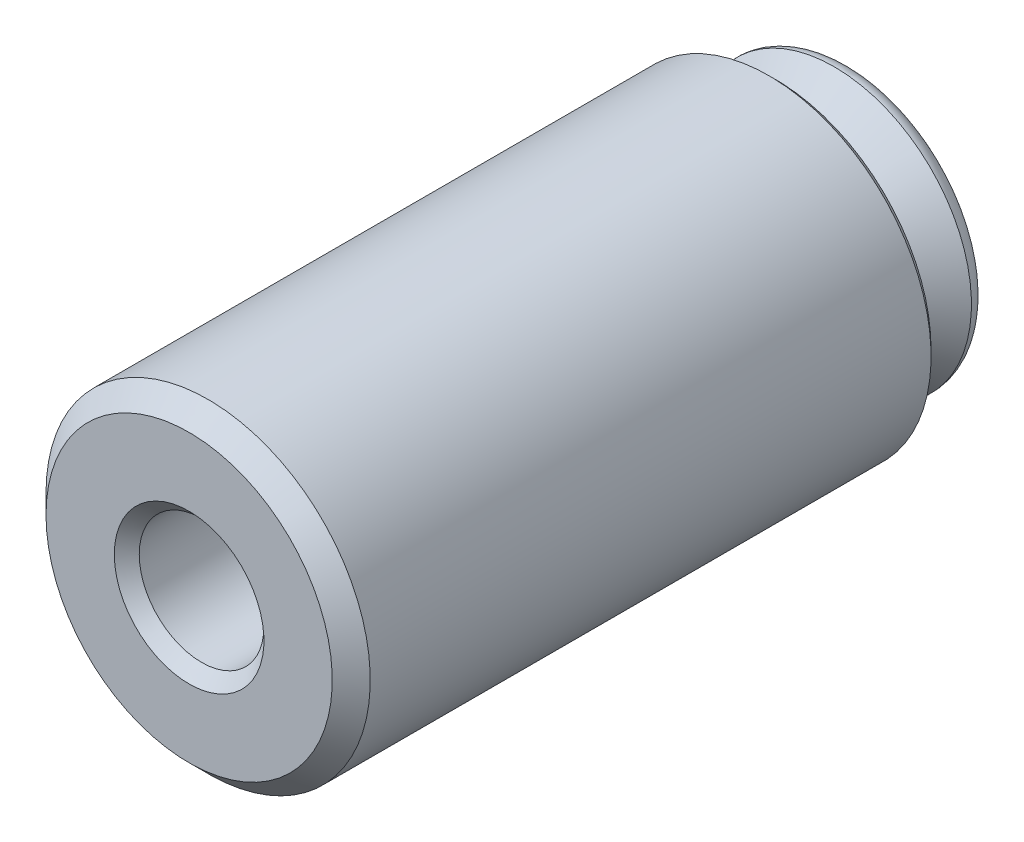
ISO-10303-21;
HEADER;
FILE_DESCRIPTION(('STEP AP214'),'2;1');
FILE_NAME('part.step','',(''),(''),'','','');
FILE_SCHEMA(('AUTOMOTIVE_DESIGN { 1 0 10303 214 1 1 1 1 }'));
ENDSEC;
DATA;
#1=APPLICATION_CONTEXT('core data for automotive mechanical design processes');
#2=APPLICATION_PROTOCOL_DEFINITION('international standard','automotive_design',2000,#1);
#3=PRODUCT_CONTEXT('',#1,'mechanical');
#4=PRODUCT('Part','Part','',(#3));
#5=PRODUCT_RELATED_PRODUCT_CATEGORY('part','',(#4));
#6=PRODUCT_DEFINITION_FORMATION('','',#4);
#7=PRODUCT_DEFINITION_CONTEXT('part definition',#1,'design');
#8=PRODUCT_DEFINITION('design','',#6,#7);
#9=PRODUCT_DEFINITION_SHAPE('','',#8);
#10=(LENGTH_UNIT() NAMED_UNIT(*) SI_UNIT(.MILLI.,.METRE.));
#11=(NAMED_UNIT(*) PLANE_ANGLE_UNIT() SI_UNIT($,.RADIAN.));
#12=(NAMED_UNIT(*) SI_UNIT($,.STERADIAN.) SOLID_ANGLE_UNIT());
#13=UNCERTAINTY_MEASURE_WITH_UNIT(LENGTH_MEASURE(1.E-05),#10,'distance_accuracy_value','');
#14=(GEOMETRIC_REPRESENTATION_CONTEXT(3) GLOBAL_UNCERTAINTY_ASSIGNED_CONTEXT((#13)) GLOBAL_UNIT_ASSIGNED_CONTEXT((#10,
#11,#12)) REPRESENTATION_CONTEXT('',''));
#15=CARTESIAN_POINT('',(0.,0.,0.));
#16=DIRECTION('',(0.,0.,1.));
#17=DIRECTION('',(1.,0.,0.));
#18=AXIS2_PLACEMENT_3D('',#15,#16,#17);
#19=CARTESIAN_POINT('',(0.,0.,6.50139999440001));
#20=DIRECTION('',(0.,0.,-1.));
#21=DIRECTION('',(-0.182612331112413,0.983184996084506,0.));
#22=AXIS2_PLACEMENT_3D('',#19,#20,#21);
#23=SPHERICAL_SURFACE('',#22,5.);
#24=CARTESIAN_POINT('',(0.,0.,4.2191999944));
#25=DIRECTION('',(0.,0.,-1.));
#26=DIRECTION('',(-1.,0.,0.));
#27=AXIS2_PLACEMENT_3D('',#24,#25,#26);
#28=CIRCLE('',#27,4.44877097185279);
#29=CARTESIAN_POINT('',(-0.812400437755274,4.37396487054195,4.2191999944));
#30=VERTEX_POINT('',#29);
#31=EDGE_CURVE('E8',#30,#30,#28,.F.);
#32=CARTESIAN_POINT('',(0.,0.,3.56696480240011));
#33=DIRECTION('',(0.,0.,1.));
#34=DIRECTION('',(-0.182612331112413,0.983184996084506,0.));
#35=AXIS2_PLACEMENT_3D('',#32,#33,#34);
#36=CIRCLE('',#35,4.04834411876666);
#37=CARTESIAN_POINT('',(-0.739277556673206,3.98027119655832,3.56696480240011));
#38=VERTEX_POINT('',#37);
#39=EDGE_CURVE('E41',#38,#38,#36,.T.);
#40=CARTESIAN_POINT('',(-0.812400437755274,4.37396487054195,4.2191999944));
#41=CARTESIAN_POINT('',(-0.811735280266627,4.370383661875,4.21209962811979));
#42=CARTESIAN_POINT('',(-0.811067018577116,4.36678574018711,4.20500798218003));
#43=CARTESIAN_POINT('',(-0.809724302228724,4.35955655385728,4.19084229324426));
#44=CARTESIAN_POINT('',(-0.809049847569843,4.35592528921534,4.18376825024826));
#45=CARTESIAN_POINT('',(-0.80769476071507,4.34862950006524,4.16963792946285));
#46=CARTESIAN_POINT('',(-0.807014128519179,4.34496497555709,4.16258165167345));
#47=CARTESIAN_POINT('',(-0.805646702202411,4.33760275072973,4.14848702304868));
#48=CARTESIAN_POINT('',(-0.804959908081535,4.33390505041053,4.14144867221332));
#49=CARTESIAN_POINT('',(-0.803580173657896,4.32647655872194,4.12739005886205));
#50=CARTESIAN_POINT('',(-0.802887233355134,4.32274576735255,4.12036979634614));
#51=CARTESIAN_POINT('',(-0.80149522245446,4.31525117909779,4.10634752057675));
#52=CARTESIAN_POINT('',(-0.800796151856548,4.31148738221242,4.09934550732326));
#53=CARTESIAN_POINT('',(-0.79939189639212,4.30392686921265,4.08535989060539));
#54=CARTESIAN_POINT('',(-0.798686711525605,4.30013015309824,4.078376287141));
#55=CARTESIAN_POINT('',(-0.797270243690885,4.29250388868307,4.06442765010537));
#56=CARTESIAN_POINT('',(-0.796558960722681,4.28867434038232,4.05746261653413));
#57=CARTESIAN_POINT('',(-0.795130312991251,4.28098249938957,4.04355127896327));
#58=CARTESIAN_POINT('',(-0.794412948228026,4.27712020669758,4.03660497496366));
#59=CARTESIAN_POINT('',(-0.792972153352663,4.26936296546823,4.0227312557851));
#60=CARTESIAN_POINT('',(-0.792248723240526,4.26546801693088,4.01580384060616));
#61=CARTESIAN_POINT('',(-0.790795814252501,4.25764555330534,4.00196805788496));
#62=CARTESIAN_POINT('',(-0.790066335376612,4.25371803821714,3.99505969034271));
#63=CARTESIAN_POINT('',(-0.788601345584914,4.24583053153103,3.98126216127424));
#64=CARTESIAN_POINT('',(-0.787865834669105,4.24187053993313,3.97437299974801));
#65=CARTESIAN_POINT('',(-0.786388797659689,4.23391817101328,3.96061404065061));
#66=CARTESIAN_POINT('',(-0.785647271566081,4.22992579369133,3.95374424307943));
#67=CARTESIAN_POINT('',(-0.784158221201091,4.22190874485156,3.94002416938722));
#68=CARTESIAN_POINT('',(-0.783410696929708,4.21788407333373,3.93317389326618));
#69=CARTESIAN_POINT('',(-0.781909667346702,4.2098025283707,3.91949301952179));
#70=CARTESIAN_POINT('',(-0.78115616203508,4.20574565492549,3.91266242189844));
#71=CARTESIAN_POINT('',(-0.779643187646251,4.19759979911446,3.89902106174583));
#72=CARTESIAN_POINT('',(-0.778883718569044,4.19351081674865,3.89221029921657));
#73=CARTESIAN_POINT('',(-0.777358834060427,4.18530083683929,3.8786087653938));
#74=CARTESIAN_POINT('',(-0.776593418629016,4.18117983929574,3.8718179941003));
#75=CARTESIAN_POINT('',(-0.775056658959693,4.17290592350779,3.85825659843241));
#76=CARTESIAN_POINT('',(-0.774285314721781,4.16875300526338,3.85148597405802));
#77=CARTESIAN_POINT('',(-0.772736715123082,4.16041534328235,3.83796502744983));
#78=CARTESIAN_POINT('',(-0.771959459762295,4.15623059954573,3.83121470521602));
#79=CARTESIAN_POINT('',(-0.770399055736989,4.14782938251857,3.81773451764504));
#80=CARTESIAN_POINT('',(-0.76961590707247,4.14361290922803,3.81100465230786));
#81=CARTESIAN_POINT('',(-0.76804373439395,4.13514832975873,3.79756553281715));
#82=CARTESIAN_POINT('',(-0.76725471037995,4.13090022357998,3.79085627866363));
#83=CARTESIAN_POINT('',(-0.765670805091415,4.12237247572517,3.77745853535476));
#84=CARTESIAN_POINT('',(-0.764875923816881,4.11809283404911,3.77077004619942));
#85=CARTESIAN_POINT('',(-0.763280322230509,4.10950211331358,3.75741398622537));
#86=CARTESIAN_POINT('',(-0.762479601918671,4.10519103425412,3.75074641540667));
#87=CARTESIAN_POINT('',(-0.760872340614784,4.09653753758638,3.7374323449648));
#88=CARTESIAN_POINT('',(-0.760065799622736,4.09219511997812,3.73078584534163));
#89=CARTESIAN_POINT('',(-0.758446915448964,4.08347904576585,3.71751406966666));
#90=CARTESIAN_POINT('',(-0.757634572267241,4.07910538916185,3.71088879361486));
#91=CARTESIAN_POINT('',(-0.756004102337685,4.07032693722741,3.69765961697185));
#92=CARTESIAN_POINT('',(-0.755185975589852,4.06592214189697,3.69105571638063));
#93=CARTESIAN_POINT('',(-0.753543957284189,4.05708151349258,3.67786944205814));
#94=CARTESIAN_POINT('',(-0.752720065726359,4.05264568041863,3.67128706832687));
#95=CARTESIAN_POINT('',(-0.751066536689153,4.04374307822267,3.65814399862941));
#96=CARTESIAN_POINT('',(-0.750236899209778,4.03927630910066,3.65158330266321));
#97=CARTESIAN_POINT('',(-0.748571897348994,4.03031193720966,3.63848373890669));
#98=CARTESIAN_POINT('',(-0.747736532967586,4.02581433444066,3.63194487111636));
#99=CARTESIAN_POINT('',(-0.746060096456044,4.01678839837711,3.61888911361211));
#100=CARTESIAN_POINT('',(-0.745219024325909,4.01226006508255,3.61237222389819));
#101=CARTESIAN_POINT('',(-0.743531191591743,4.00317277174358,3.59936057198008));
#102=CARTESIAN_POINT('',(-0.742684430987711,3.99861381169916,3.5928658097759));
#103=CARTESIAN_POINT('',(-0.740985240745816,3.9894653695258,3.57989856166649));
#104=CARTESIAN_POINT('',(-0.740132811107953,3.98487588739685,3.57342607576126));
#105=CARTESIAN_POINT('',(-0.739277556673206,3.98027119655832,3.56696480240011));
#106=B_SPLINE_CURVE_WITH_KNOTS('',3,(#40,#41,#42,#43,#44,#45,#46,#47,#48,#49,#50,#51,#52,#53,
#54,#55,#56,#57,#58,#59,#60,#61,#62,#63,#64,#65,#66,#67,#68,#69,#70,#71,#72,#73,#74,#75,#76,#77,
#78,#79,#80,#81,#82,#83,#84,#85,#86,#87,#88,#89,#90,#91,#92,#93,#94,#95,#96,#97,#98,#99,#100,
#101,#102,#103,#104,#105),.UNSPECIFIED.,.F.,.F.,(4,2,2,2,2,2,2,2,2,2,2,2,2,2,2,2,2,2,2,2,2,2,2,
2,2,2,2,2,2,2,2,2,4),(0.,0.0239404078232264,0.0478808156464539,0.0718212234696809,
0.0957616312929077,0.119702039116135,0.143642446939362,0.167582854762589,0.191523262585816,
0.215463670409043,0.23940407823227,0.263344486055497,0.287284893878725,0.311225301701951,
0.335165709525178,0.359106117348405,0.383046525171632,0.406986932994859,0.430927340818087,
0.454867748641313,0.47880815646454,0.502748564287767,0.526688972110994,0.550629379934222,
0.574569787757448,0.598510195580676,0.622450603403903,0.646391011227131,0.670331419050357,
0.694271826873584,0.718212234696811,0.742152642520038,0.766093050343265),.UNSPECIFIED.);
#107=EDGE_CURVE('BSEAM13',#30,#38,#106,.T.);
#108=ORIENTED_EDGE('',*,*,#31,.F.);
#109=ORIENTED_EDGE('',*,*,#39,.T.);
#110=ORIENTED_EDGE('',*,*,#107,.T.);
#111=ORIENTED_EDGE('',*,*,#107,.F.);
#112=EDGE_LOOP('',(#108,#110,#109,#111));
#113=FACE_BOUND('',#112,.T.);
#114=ADVANCED_FACE('F13',(#113),#23,.T.);
#115=CARTESIAN_POINT('',(0.,0.,0.));
#116=DIRECTION('',(0.,0.,-1.));
#117=DIRECTION('',(0.182612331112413,-0.983184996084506,0.));
#118=AXIS2_PLACEMENT_3D('',#115,#116,#117);
#119=CYLINDRICAL_SURFACE('',#118,4.);
#120=CARTESIAN_POINT('',(0.,0.,3.4178954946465));
#121=DIRECTION('',(0.,0.,1.));
#122=DIRECTION('',(-0.182612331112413,0.983184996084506,0.));
#123=AXIS2_PLACEMENT_3D('',#120,#121,#122);
#124=CIRCLE('',#123,4.);
#125=CARTESIAN_POINT('',(-0.730449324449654,3.93273998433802,3.4178954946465));
#126=VERTEX_POINT('',#125);
#127=EDGE_CURVE('E39',#126,#126,#124,.F.);
#128=ORIENTED_EDGE('',*,*,#127,.T.);
#129=EDGE_LOOP('',(#128));
#130=FACE_BOUND('',#129,.T.);
#131=CARTESIAN_POINT('',(0.,0.,2.24021024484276));
#132=DIRECTION('',(0.,0.,-1.));
#133=DIRECTION('',(0.182612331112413,-0.983184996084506,0.));
#134=AXIS2_PLACEMENT_3D('',#131,#132,#133);
#135=CIRCLE('',#134,4.);
#136=CARTESIAN_POINT('',(0.730449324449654,-3.93273998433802,2.24021024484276));
#137=VERTEX_POINT('',#136);
#138=EDGE_CURVE('E36',#137,#137,#135,.F.);
#139=ORIENTED_EDGE('',*,*,#138,.T.);
#140=EDGE_LOOP('',(#139));
#141=FACE_BOUND('',#140,.T.);
#142=ADVANCED_FACE('F297',(#130,#141),#119,.T.);
#143=CARTESIAN_POINT('',(0.,0.,2.135));
#144=DIRECTION('',(0.,0.,-1.));
#145=DIRECTION('',(0.182612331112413,-0.983184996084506,0.));
#146=AXIS2_PLACEMENT_3D('',#143,#144,#145);
#147=CONICAL_SURFACE('',#146,4.,0.78539816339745);
#148=CARTESIAN_POINT('',(0.,0.,2.06060512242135));
#149=DIRECTION('',(0.,0.,-1.));
#150=DIRECTION('',(0.182612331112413,-0.983184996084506,0.));
#151=AXIS2_PLACEMENT_3D('',#148,#149,#150);
#152=CIRCLE('',#151,4.07439487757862);
#153=CARTESIAN_POINT('',(0.744034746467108,-4.00588391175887,2.06060512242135));
#154=VERTEX_POINT('',#153);
#155=EDGE_CURVE('E17',#154,#154,#152,.T.);
#156=ORIENTED_EDGE('',*,*,#155,.T.);
#157=EDGE_LOOP('',(#156));
#158=FACE_BOUND('',#157,.T.);
#159=CARTESIAN_POINT('',(0.,0.,0.635));
#160=DIRECTION('',(0.,0.,-1.));
#161=DIRECTION('',(0.182612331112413,-0.983184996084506,0.));
#162=AXIS2_PLACEMENT_3D('',#159,#160,#161);
#163=CIRCLE('',#162,5.5);
#164=CARTESIAN_POINT('',(1.00436782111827,-5.40751747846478,0.635));
#165=VERTEX_POINT('',#164);
#166=EDGE_CURVE('E30',#165,#165,#163,.T.);
#167=ORIENTED_EDGE('',*,*,#166,.F.);
#168=EDGE_LOOP('',(#167));
#169=FACE_BOUND('',#168,.T.);
#170=ADVANCED_FACE('F289',(#158,#169),#147,.T.);
#171=CARTESIAN_POINT('',(-1.00436782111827,5.40751747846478,0.));
#172=DIRECTION('',(0.,0.,1.));
#173=DIRECTION('',(-0.182612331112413,0.983184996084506,0.));
#174=AXIS2_PLACEMENT_3D('',#171,#172,#173);
#175=PLANE('',#174);
#176=CARTESIAN_POINT('',(0.,0.,0.));
#177=DIRECTION('',(0.,0.,1.));
#178=DIRECTION('',(-0.182612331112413,0.983184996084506,0.));
#179=AXIS2_PLACEMENT_3D('',#176,#177,#178);
#180=CIRCLE('',#179,4.865);
#181=CARTESIAN_POINT('',(-0.888408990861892,4.78319500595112,0.));
#182=VERTEX_POINT('',#181);
#183=EDGE_CURVE('E33',#182,#182,#180,.F.);
#184=ORIENTED_EDGE('',*,*,#183,.T.);
#185=EDGE_LOOP('',(#184));
#186=FACE_BOUND('',#185,.T.);
#187=ADVANCED_FACE('F280',(#186),#175,.F.);
#188=CARTESIAN_POINT('',(0.,0.,0.635));
#189=DIRECTION('',(0.,0.,1.));
#190=DIRECTION('',(-0.182612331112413,0.983184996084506,0.));
#191=AXIS2_PLACEMENT_3D('',#188,#189,#190);
#192=TOROIDAL_SURFACE('',#191,4.865,0.635);
#193=ORIENTED_EDGE('',*,*,#166,.T.);
#194=EDGE_LOOP('',(#193));
#195=FACE_BOUND('',#194,.T.);
#196=ORIENTED_EDGE('',*,*,#183,.F.);
#197=EDGE_LOOP('',(#196));
#198=FACE_BOUND('',#197,.T.);
#199=ADVANCED_FACE('F272',(#195,#198),#192,.T.);
#200=CARTESIAN_POINT('',(0.,0.,3.4178954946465));
#201=DIRECTION('',(0.,0.,1.));
#202=DIRECTION('',(-0.182612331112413,0.983184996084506,0.));
#203=AXIS2_PLACEMENT_3D('',#200,#201,#202);
#204=TOROIDAL_SURFACE('',#203,4.254,0.254);
#205=ORIENTED_EDGE('',*,*,#39,.F.);
#206=EDGE_LOOP('',(#205));
#207=FACE_BOUND('',#206,.T.);
#208=ORIENTED_EDGE('',*,*,#127,.F.);
#209=EDGE_LOOP('',(#208));
#210=FACE_BOUND('',#209,.T.);
#211=ADVANCED_FACE('F115',(#207,#210),#204,.F.);
#212=CARTESIAN_POINT('',(0.,0.,2.24021024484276));
#213=DIRECTION('',(0.,0.,-1.));
#214=DIRECTION('',(0.182612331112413,-0.983184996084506,0.));
#215=AXIS2_PLACEMENT_3D('',#212,#213,#214);
#216=TOROIDAL_SURFACE('',#215,4.254,0.254);
#217=ORIENTED_EDGE('',*,*,#138,.F.);
#218=EDGE_LOOP('',(#217));
#219=FACE_BOUND('',#218,.T.);
#220=ORIENTED_EDGE('',*,*,#155,.F.);
#221=EDGE_LOOP('',(#220));
#222=FACE_BOUND('',#221,.T.);
#223=ADVANCED_FACE('F15',(#219,#222),#216,.F.);
#224=CARTESIAN_POINT('',(0.,0.,17.4999999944));
#225=DIRECTION('',(0.,0.,1.));
#226=DIRECTION('',(1.,0.,0.));
#227=AXIS2_PLACEMENT_3D('',#224,#225,#226);
#228=PLANE('',#227);
#229=CARTESIAN_POINT('',(0.,0.,17.4999999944));
#230=DIRECTION('',(0.,0.,1.));
#231=DIRECTION('',(1.,0.,0.));
#232=AXIS2_PLACEMENT_3D('',#229,#230,#231);
#233=CIRCLE('',#232,2.5);
#234=CARTESIAN_POINT('',(2.5,0.,17.4999999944));
#235=VERTEX_POINT('',#234);
#236=EDGE_CURVE('E46',#235,#235,#233,.T.);
#237=ORIENTED_EDGE('',*,*,#236,.T.);
#238=EDGE_LOOP('',(#237));
#239=FACE_BOUND('',#238,.T.);
#240=ADVANCED_FACE('F105',(#239),#228,.T.);
#241=CARTESIAN_POINT('',(0.,0.,17.4999999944));
#242=DIRECTION('',(0.,0.,1.));
#243=DIRECTION('',(1.,0.,0.));
#244=AXIS2_PLACEMENT_3D('',#241,#242,#243);
#245=CYLINDRICAL_SURFACE('',#244,2.5);
#246=CARTESIAN_POINT('',(0.,0.,25.9999999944));
#247=DIRECTION('',(0.,0.,-1.));
#248=DIRECTION('',(-1.,0.,0.));
#249=AXIS2_PLACEMENT_3D('',#246,#247,#248);
#250=CIRCLE('',#249,2.5);
#251=CARTESIAN_POINT('',(-2.5,0.,25.9999999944));
#252=VERTEX_POINT('',#251);
#253=EDGE_CURVE('E26',#252,#252,#250,.F.);
#254=ORIENTED_EDGE('',*,*,#253,.T.);
#255=EDGE_LOOP('',(#254));
#256=FACE_BOUND('',#255,.T.);
#257=ORIENTED_EDGE('',*,*,#236,.F.);
#258=EDGE_LOOP('',(#257));
#259=FACE_BOUND('',#258,.T.);
#260=ADVANCED_FACE('F89',(#256,#259),#245,.F.);
#261=CARTESIAN_POINT('',(0.,0.,25.9999999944));
#262=DIRECTION('',(0.,0.,1.));
#263=DIRECTION('',(1.,0.,0.));
#264=AXIS2_PLACEMENT_3D('',#261,#262,#263);
#265=CONICAL_SURFACE('',#264,2.5,0.785398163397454);
#266=CARTESIAN_POINT('',(0.,0.,26.4999999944));
#267=DIRECTION('',(0.,0.,-1.));
#268=DIRECTION('',(-1.,0.,0.));
#269=AXIS2_PLACEMENT_3D('',#266,#267,#268);
#270=CIRCLE('',#269,3.);
#271=CARTESIAN_POINT('',(-3.,0.,26.4999999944));
#272=VERTEX_POINT('',#271);
#273=EDGE_CURVE('E21',#272,#272,#270,.T.);
#274=ORIENTED_EDGE('',*,*,#273,.F.);
#275=EDGE_LOOP('',(#274));
#276=FACE_BOUND('',#275,.T.);
#277=ORIENTED_EDGE('',*,*,#253,.F.);
#278=EDGE_LOOP('',(#277));
#279=FACE_BOUND('',#278,.T.);
#280=ADVANCED_FACE('F92',(#276,#279),#265,.F.);
#281=CARTESIAN_POINT('',(0.,0.,26.4999999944));
#282=DIRECTION('',(0.,0.,-1.));
#283=DIRECTION('',(-1.,0.,0.));
#284=AXIS2_PLACEMENT_3D('',#281,#282,#283);
#285=PLANE('',#284);
#286=ORIENTED_EDGE('',*,*,#273,.T.);
#287=EDGE_LOOP('',(#286));
#288=FACE_BOUND('',#287,.T.);
#289=CARTESIAN_POINT('',(0.,0.,26.4999999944));
#290=DIRECTION('',(0.,0.,-1.));
#291=DIRECTION('',(-1.,0.,0.));
#292=AXIS2_PLACEMENT_3D('',#289,#290,#291);
#293=CIRCLE('',#292,5.738);
#294=CARTESIAN_POINT('',(-5.738,0.,26.4999999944));
#295=VERTEX_POINT('',#294);
#296=EDGE_CURVE('E61',#295,#295,#293,.F.);
#297=ORIENTED_EDGE('',*,*,#296,.T.);
#298=EDGE_LOOP('',(#297));
#299=FACE_BOUND('',#298,.T.);
#300=ADVANCED_FACE('F94',(#288,#299),#285,.F.);
#301=CARTESIAN_POINT('',(0.,0.,25.7379999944));
#302=DIRECTION('',(0.,0.,-1.));
#303=DIRECTION('',(-1.,0.,0.));
#304=AXIS2_PLACEMENT_3D('',#301,#302,#303);
#305=CONICAL_SURFACE('',#304,6.5,0.78539816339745);
#306=ORIENTED_EDGE('',*,*,#296,.F.);
#307=EDGE_LOOP('',(#306));
#308=FACE_BOUND('',#307,.T.);
#309=CARTESIAN_POINT('',(0.,0.,25.7379999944));
#310=DIRECTION('',(0.,0.,-1.));
#311=DIRECTION('',(-1.,0.,0.));
#312=AXIS2_PLACEMENT_3D('',#309,#310,#311);
#313=CIRCLE('',#312,6.5);
#314=CARTESIAN_POINT('',(-6.5,0.,25.7379999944));
#315=VERTEX_POINT('',#314);
#316=EDGE_CURVE('E82',#315,#315,#313,.T.);
#317=ORIENTED_EDGE('',*,*,#316,.F.);
#318=EDGE_LOOP('',(#317));
#319=FACE_BOUND('',#318,.T.);
#320=ADVANCED_FACE('F102',(#308,#319),#305,.T.);
#321=CARTESIAN_POINT('',(0.,0.,26.4999999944));
#322=DIRECTION('',(0.,0.,-1.));
#323=DIRECTION('',(-1.,0.,0.));
#324=AXIS2_PLACEMENT_3D('',#321,#322,#323);
#325=CYLINDRICAL_SURFACE('',#324,6.5);
#326=ORIENTED_EDGE('',*,*,#316,.T.);
#327=EDGE_LOOP('',(#326));
#328=FACE_BOUND('',#327,.T.);
#329=CARTESIAN_POINT('',(0.,0.,3.2539999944));
#330=DIRECTION('',(0.,0.,-1.));
#331=DIRECTION('',(-1.,0.,0.));
#332=AXIS2_PLACEMENT_3D('',#329,#330,#331);
#333=CIRCLE('',#332,6.5);
#334=CARTESIAN_POINT('',(-6.5,0.,3.2539999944));
#335=VERTEX_POINT('',#334);
#336=EDGE_CURVE('E79',#335,#335,#333,.F.);
#337=ORIENTED_EDGE('',*,*,#336,.T.);
#338=EDGE_LOOP('',(#337));
#339=FACE_BOUND('',#338,.T.);
#340=ADVANCED_FACE('F149',(#328,#339),#325,.T.);
#341=CARTESIAN_POINT('',(0.,0.,2.99999999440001));
#342=DIRECTION('',(0.,0.,1.));
#343=DIRECTION('',(1.,0.,0.));
#344=AXIS2_PLACEMENT_3D('',#341,#342,#343);
#345=CONICAL_SURFACE('',#344,6.246,0.785398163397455);
#346=ORIENTED_EDGE('',*,*,#336,.F.);
#347=EDGE_LOOP('',(#346));
#348=FACE_BOUND('',#347,.T.);
#349=CARTESIAN_POINT('',(0.,0.,2.99999999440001));
#350=DIRECTION('',(0.,0.,-1.));
#351=DIRECTION('',(-1.,0.,0.));
#352=AXIS2_PLACEMENT_3D('',#349,#350,#351);
#353=CIRCLE('',#352,6.246);
#354=CARTESIAN_POINT('',(-6.246,0.,2.99999999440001));
#355=VERTEX_POINT('',#354);
#356=EDGE_CURVE('E73',#355,#355,#353,.T.);
#357=ORIENTED_EDGE('',*,*,#356,.F.);
#358=EDGE_LOOP('',(#357));
#359=FACE_BOUND('',#358,.T.);
#360=ADVANCED_FACE('F147',(#348,#359),#345,.T.);
#361=CARTESIAN_POINT('',(0.,0.,2.99999999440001));
#362=DIRECTION('',(0.,0.,-1.));
#363=DIRECTION('',(-1.,0.,0.));
#364=AXIS2_PLACEMENT_3D('',#361,#362,#363);
#365=PLANE('',#364);
#366=CARTESIAN_POINT('',(0.,0.,2.99999999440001));
#367=DIRECTION('',(0.,0.,-1.));
#368=DIRECTION('',(-1.,0.,0.));
#369=AXIS2_PLACEMENT_3D('',#366,#367,#368);
#370=CIRCLE('',#369,5.3213);
#371=CARTESIAN_POINT('',(-5.3213,0.,2.99999999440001));
#372=VERTEX_POINT('',#371);
#373=EDGE_CURVE('E76',#372,#372,#370,.F.);
#374=ORIENTED_EDGE('',*,*,#373,.T.);
#375=EDGE_LOOP('',(#374));
#376=FACE_BOUND('',#375,.T.);
#377=ORIENTED_EDGE('',*,*,#356,.T.);
#378=EDGE_LOOP('',(#377));
#379=FACE_BOUND('',#378,.T.);
#380=ADVANCED_FACE('F144',(#376,#379),#365,.T.);
#381=CARTESIAN_POINT('',(0.,0.,3.2539999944));
#382=DIRECTION('',(0.,0.,-1.));
#383=DIRECTION('',(-1.,0.,0.));
#384=AXIS2_PLACEMENT_3D('',#381,#382,#383);
#385=CONICAL_SURFACE('',#384,5.0673,0.785398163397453);
#386=ORIENTED_EDGE('',*,*,#373,.F.);
#387=EDGE_LOOP('',(#386));
#388=FACE_BOUND('',#387,.T.);
#389=CARTESIAN_POINT('',(0.,0.,3.2539999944));
#390=DIRECTION('',(0.,0.,-1.));
#391=DIRECTION('',(-1.,0.,0.));
#392=AXIS2_PLACEMENT_3D('',#389,#390,#391);
#393=CIRCLE('',#392,5.0673);
#394=CARTESIAN_POINT('',(-5.0673,0.,3.2539999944));
#395=VERTEX_POINT('',#394);
#396=EDGE_CURVE('E68',#395,#395,#393,.T.);
#397=ORIENTED_EDGE('',*,*,#396,.F.);
#398=EDGE_LOOP('',(#397));
#399=FACE_BOUND('',#398,.T.);
#400=ADVANCED_FACE('F141',(#388,#399),#385,.F.);
#401=CARTESIAN_POINT('',(0.,0.,8.4355999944));
#402=DIRECTION('',(0.,0.,-1.));
#403=DIRECTION('',(-1.,0.,0.));
#404=AXIS2_PLACEMENT_3D('',#401,#402,#403);
#405=CYLINDRICAL_SURFACE('',#404,5.0673);
#406=ORIENTED_EDGE('',*,*,#396,.T.);
#407=EDGE_LOOP('',(#406));
#408=FACE_BOUND('',#407,.T.);
#409=CARTESIAN_POINT('',(0.,0.,4.2191999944));
#410=DIRECTION('',(0.,0.,-1.));
#411=DIRECTION('',(-1.,0.,0.));
#412=AXIS2_PLACEMENT_3D('',#409,#410,#411);
#413=CIRCLE('',#412,5.0673);
#414=CARTESIAN_POINT('',(-5.0673,0.,4.2191999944));
#415=VERTEX_POINT('',#414);
#416=EDGE_CURVE('E55',#415,#415,#413,.F.);
#417=ORIENTED_EDGE('',*,*,#416,.T.);
#418=EDGE_LOOP('',(#417));
#419=FACE_BOUND('',#418,.T.);
#420=ADVANCED_FACE('F127',(#408,#419),#405,.F.);
#421=CARTESIAN_POINT('',(0.,0.,4.2191999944));
#422=DIRECTION('',(0.,0.,-1.));
#423=DIRECTION('',(-1.,0.,0.));
#424=AXIS2_PLACEMENT_3D('',#421,#422,#423);
#425=PLANE('',#424);
#426=ORIENTED_EDGE('',*,*,#416,.F.);
#427=EDGE_LOOP('',(#426));
#428=FACE_BOUND('',#427,.T.);
#429=ORIENTED_EDGE('',*,*,#31,.T.);
#430=EDGE_LOOP('',(#429));
#431=FACE_BOUND('',#430,.T.);
#432=ADVANCED_FACE('F124',(#428,#431),#425,.T.);
#433=CLOSED_SHELL('',(#114,#142,#170,#187,#199,#211,#223,#240,#260,#280,#300,#320,#340,#360,
#380,#400,#420,#432));
#434=CARTESIAN_POINT('',(0.,0.,5.3621999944));
#435=DIRECTION('',(0.,0.,-1.));
#436=DIRECTION('',(-1.,0.,0.));
#437=AXIS2_PLACEMENT_3D('',#434,#435,#436);
#438=PLANE('',#437);
#439=CARTESIAN_POINT('',(0.,0.,5.3621999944));
#440=DIRECTION('',(0.,0.,-1.));
#441=DIRECTION('',(-1.,0.,0.));
#442=AXIS2_PLACEMENT_3D('',#439,#440,#441);
#443=CIRCLE('',#442,5.738);
#444=CARTESIAN_POINT('',(-5.738,0.,5.3621999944));
#445=VERTEX_POINT('',#444);
#446=EDGE_CURVE('E58',#445,#445,#443,.T.);
#447=ORIENTED_EDGE('',*,*,#446,.F.);
#448=EDGE_LOOP('',(#447));
#449=FACE_BOUND('',#448,.T.);
#450=CARTESIAN_POINT('',(0.,0.,5.3621999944));
#451=DIRECTION('',(0.,0.,-1.));
#452=DIRECTION('',(-1.,0.,0.));
#453=AXIS2_PLACEMENT_3D('',#450,#451,#452);
#454=CIRCLE('',#453,5.7404);
#455=CARTESIAN_POINT('',(-5.7404,0.,5.3621999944));
#456=VERTEX_POINT('',#455);
#457=EDGE_CURVE('E65',#456,#456,#454,.T.);
#458=ORIENTED_EDGE('',*,*,#457,.T.);
#459=EDGE_LOOP('',(#458));
#460=FACE_BOUND('',#459,.T.);
#461=ADVANCED_FACE('F129',(#449,#460),#438,.T.);
#462=CARTESIAN_POINT('',(0.,0.,4.2191999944));
#463=DIRECTION('',(0.,0.,-1.));
#464=DIRECTION('',(-1.,0.,0.));
#465=AXIS2_PLACEMENT_3D('',#462,#463,#464);
#466=PLANE('',#465);
#467=CARTESIAN_POINT('',(0.,0.,4.2191999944));
#468=DIRECTION('',(0.,0.,-1.));
#469=DIRECTION('',(-1.,0.,0.));
#470=AXIS2_PLACEMENT_3D('',#467,#468,#469);
#471=CIRCLE('',#470,5.738);
#472=CARTESIAN_POINT('',(-5.738,0.,4.2191999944));
#473=VERTEX_POINT('',#472);
#474=EDGE_CURVE('E50',#473,#473,#471,.F.);
#475=ORIENTED_EDGE('',*,*,#474,.F.);
#476=EDGE_LOOP('',(#475));
#477=FACE_BOUND('',#476,.T.);
#478=CARTESIAN_POINT('',(0.,0.,4.2191999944));
#479=DIRECTION('',(0.,0.,-1.));
#480=DIRECTION('',(-1.,0.,0.));
#481=AXIS2_PLACEMENT_3D('',#478,#479,#480);
#482=CIRCLE('',#481,5.7404);
#483=CARTESIAN_POINT('',(-5.7404,0.,4.2191999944));
#484=VERTEX_POINT('',#483);
#485=EDGE_CURVE('E64',#484,#484,#482,.T.);
#486=ORIENTED_EDGE('',*,*,#485,.F.);
#487=EDGE_LOOP('',(#486));
#488=FACE_BOUND('',#487,.T.);
#489=ADVANCED_FACE('F132',(#477,#488),#466,.F.);
#490=CARTESIAN_POINT('',(0.,0.,5.3621999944));
#491=DIRECTION('',(0.,0.,-1.));
#492=DIRECTION('',(-1.,0.,0.));
#493=AXIS2_PLACEMENT_3D('',#490,#491,#492);
#494=CYLINDRICAL_SURFACE('',#493,5.7404);
#495=ORIENTED_EDGE('',*,*,#457,.F.);
#496=EDGE_LOOP('',(#495));
#497=FACE_BOUND('',#496,.T.);
#498=ORIENTED_EDGE('',*,*,#485,.T.);
#499=EDGE_LOOP('',(#498));
#500=FACE_BOUND('',#499,.T.);
#501=ADVANCED_FACE('F121',(#497,#500),#494,.F.);
#502=CARTESIAN_POINT('',(0.,0.,-12.0103148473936));
#503=DIRECTION('',(0.,0.,1.));
#504=DIRECTION('',(1.,0.,0.));
#505=AXIS2_PLACEMENT_3D('',#502,#503,#504);
#506=CYLINDRICAL_SURFACE('',#505,5.738);
#507=ORIENTED_EDGE('',*,*,#446,.T.);
#508=EDGE_LOOP('',(#507));
#509=FACE_BOUND('',#508,.T.);
#510=ORIENTED_EDGE('',*,*,#474,.T.);
#511=EDGE_LOOP('',(#510));
#512=FACE_BOUND('',#511,.T.);
#513=ADVANCED_FACE('F118',(#509,#512),#506,.T.);
#514=CLOSED_SHELL('',(#461,#489,#501,#513));
#515=ORIENTED_CLOSED_SHELL('',*,#514,.T.);
#516=BREP_WITH_VOIDS('B1',#433,(#515));
#517=ADVANCED_BREP_SHAPE_REPRESENTATION('',(#18,#516),#14);
#518=SHAPE_DEFINITION_REPRESENTATION(#9,#517);
ENDSEC;
END-ISO-10303-21;
